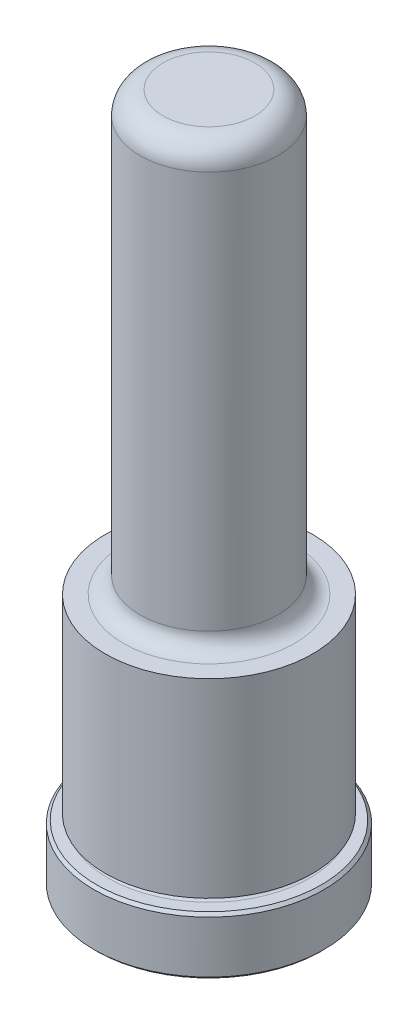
from build123d import *

# Parameters (mm, degrees)
CHAMFER1_SIZE = 0.381
FILLET7_R     = 3.175


with BuildPart() as part:
    # Sketch1 → Revolve1 (revolve)
    with BuildSketch(Plane(origin=(0, 0, 0), x_dir=(0, 0, -1), z_dir=(1, 0, 0)), mode=Mode.PRIVATE) as revolve1_sk:
        with BuildLine():
            Line((0, 0), (15.875, 0))
            Line((15.875, 0), (15.875, 7.9248))
            Line((15.875, 7.9248), (13.8938, 7.9248))
            ThreePointArc((13.8938, 7.9248), (13.5128, 8.3058), (13.8938, 8.6868))
            Line((13.8938, 8.6868), (14.3002, 8.6868))
            Line((14.3002, 8.6868), (14.3002, 34.925))
            Line((14.3002, 34.925), (11.7983, 34.925))
            ThreePointArc((11.7983, 34.925), (10.181853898, 35.594553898), (9.5123, 37.211))
            Line((9.5123, 37.211), (9.5123, 95.25))
            Line((9.5123, 95.25), (0, 95.25))
            Line((0, 95.25), (0, 0))
        make_face()
    revolve(revolve1_sk.sketch.rotate(Axis((0, 0, 0), (0, -1, 0)), 180), axis=Axis((0, 0, 0), (0, -1, 0)))

    # Chamfer1
    chamfer1_edges = [part.edges().sort_by_distance(p)[0] for p in [
        (0, 7.9248, -15.875),
        (0, 0, -15.875),
    ]]
    chamfer(chamfer1_edges, length=CHAMFER1_SIZE)

    # Fillet7
    fillet7_edges = [part.edges().sort_by_distance(p)[0] for p in [
        (0, 95.25, -9.5123),
    ]]
    fillet(fillet7_edges, radius=FILLET7_R)


solid = part.part
